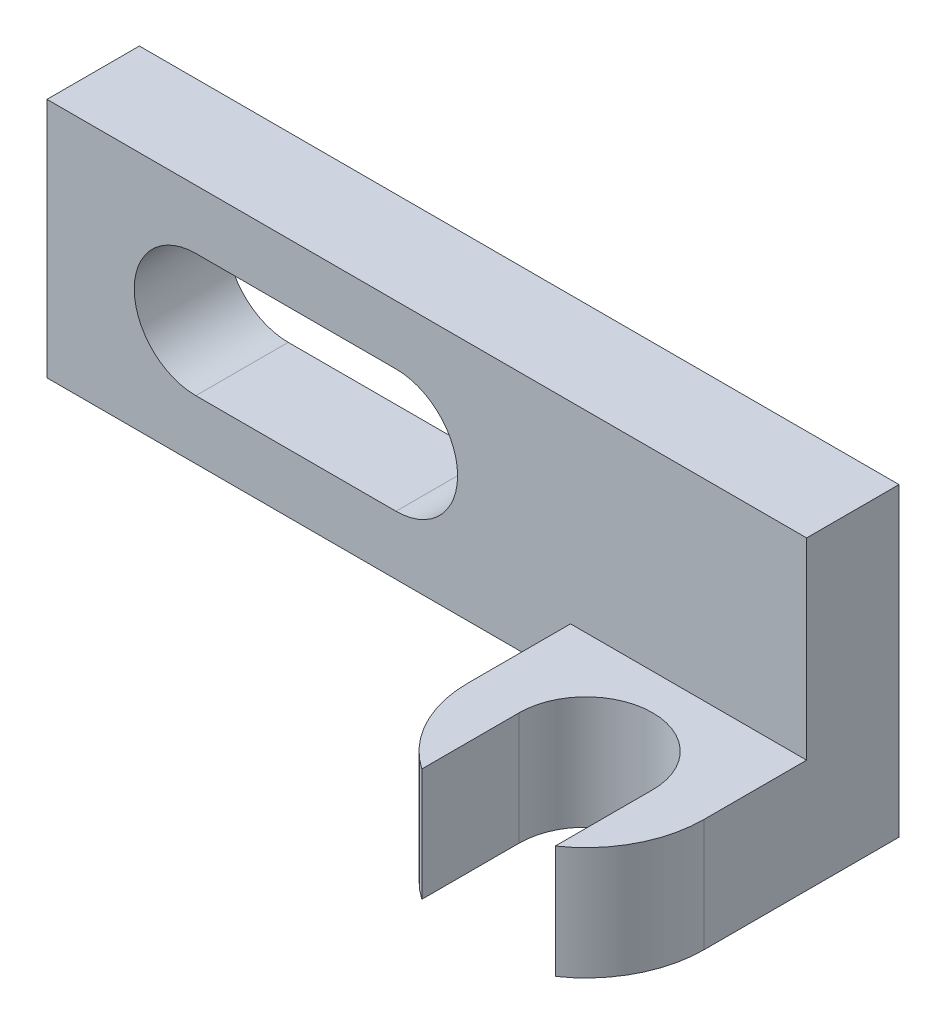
from build123d import *

# Parameters (mm, degrees)
SKETCH_1_W      = 296
SKETCH_1_H      = 94
EXTRUDE_1_DEPTH = 36
EXTRUDE_2_DEPTH = 44


with BuildPart() as part:
    # Sketch 1 → Extrude 1 (new body)
    with BuildSketch(Plane.XY):
        with Locations((90, 0)):
            Rectangle(SKETCH_1_W, SKETCH_1_H)
        with BuildLine():
            Line((0, 24), (78, 24))
            ThreePointArc((78, 24), (102, 0), (78, -24))
            Line((78, -24), (0, -24))
            ThreePointArc((0, -24), (-24, 0), (0, 24))
        make_face(mode=Mode.SUBTRACT)
    extrude(amount=EXTRUDE_1_DEPTH)

    # Sketch 2 → Extrude 2 (add)
    with BuildSketch(Plane(origin=(0, -28, 0), x_dir=(-1, 0, 0), z_dir=(0, 1, 0))):
        with BuildLine():
            Line((-146, 0), (-146, 76))
            ThreePointArc((-146, 76), (-151.306020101, 97.44761059), (-166, 113.947331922))
            Line((-166, 113.947331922), (-166, 76))
            ThreePointArc((-166, 76), (-192, 50), (-218, 76))
            Line((-218, 76), (-218, 113.947331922))
            ThreePointArc((-218, 113.947331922), (-232.693979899, 97.44761059), (-238, 76))
            Line((-238, 76), (-238, 0))
            Line((-238, 0), (-146, 0))
        make_face()
    extrude(amount=-EXTRUDE_2_DEPTH)


solid = part.part
